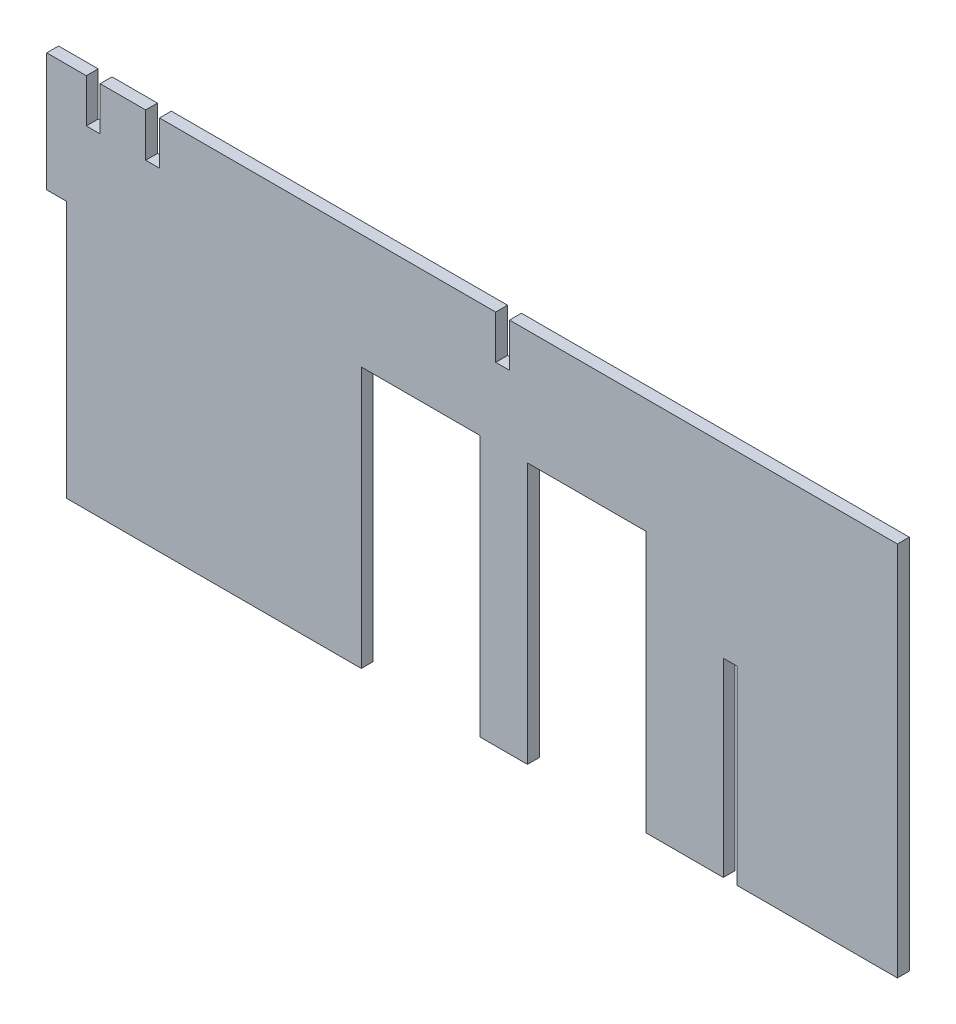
from build123d import *

# Parameters (mm, degrees)
ESQUISSE1_W             = 215
ESQUISSE1_H             = 95
EXTRUSION1_DEPTH        = 3
ESQUISSE2_W             = 5
ESQUISSE2_H             = 65
ENL_V_MAT_EXTRU_1_DEPTH = 3
ESQUISSE3_W             = 30
ESQUISSE3_H             = 66
ENL_V_MAT_EXTRU_2_DEPTH = 3
ESQUISSE5_W             = 3.5
ESQUISSE5_H             = 11
ENL_V_MAT_EXTRU_4_DEPTH = 3
ESQUISSE6_W             = 3.5
ESQUISSE6_H             = 48
ENL_V_MAT_EXTRU_5_DEPTH = 3


with BuildPart() as part:
    # Esquisse1 → Extrusion1 (new body)
    with BuildSketch(Plane.XY):
        with Locations((107.5, 47.5)):
            Rectangle(ESQUISSE1_W, ESQUISSE1_H)
    extrude(amount=EXTRUSION1_DEPTH)

    # Esquisse2 → Enl_v. mat.-Extru.1 (cut)
    with BuildSketch(Plane.XY.offset(3)):
        with Locations((2.5, 32.5)):
            Rectangle(ESQUISSE2_W, ESQUISSE2_H)
    extrude(amount=-ENL_V_MAT_EXTRU_1_DEPTH, mode=Mode.SUBTRACT)

    # Esquisse3 → Enl_v. mat.-Extru.2 (cut)
    with BuildSketch(Plane.XY.offset(3)):
        with Locations((94.5, 33)):
            Rectangle(ESQUISSE3_W, ESQUISSE3_H)
        with Locations((136.5, 33)):
            Rectangle(ESQUISSE3_W, ESQUISSE3_H)
    extrude(amount=-ENL_V_MAT_EXTRU_2_DEPTH, mode=Mode.SUBTRACT)

    # Esquisse5 → Enl_v. mat.-Extru.4 (cut)
    with BuildSketch(Plane.XY.offset(3)):
        with Locations((11.75, 89.5)):
            Rectangle(ESQUISSE5_W, ESQUISSE5_H)
        with Locations((26.75, 89.5)):
            Rectangle(ESQUISSE5_W, ESQUISSE5_H)
        with Locations((115.220074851, 89.5)):
            Rectangle(ESQUISSE5_W, ESQUISSE5_H)
    extrude(amount=-ENL_V_MAT_EXTRU_4_DEPTH, mode=Mode.SUBTRACT)

    # Esquisse6 → Enl_v. mat.-Extru.5 (cut)
    with BuildSketch(Plane.XY.offset(3)):
        with Locations((172.75, 24)):
            Rectangle(ESQUISSE6_W, ESQUISSE6_H)
    extrude(amount=-ENL_V_MAT_EXTRU_5_DEPTH, mode=Mode.SUBTRACT)


solid = part.part
